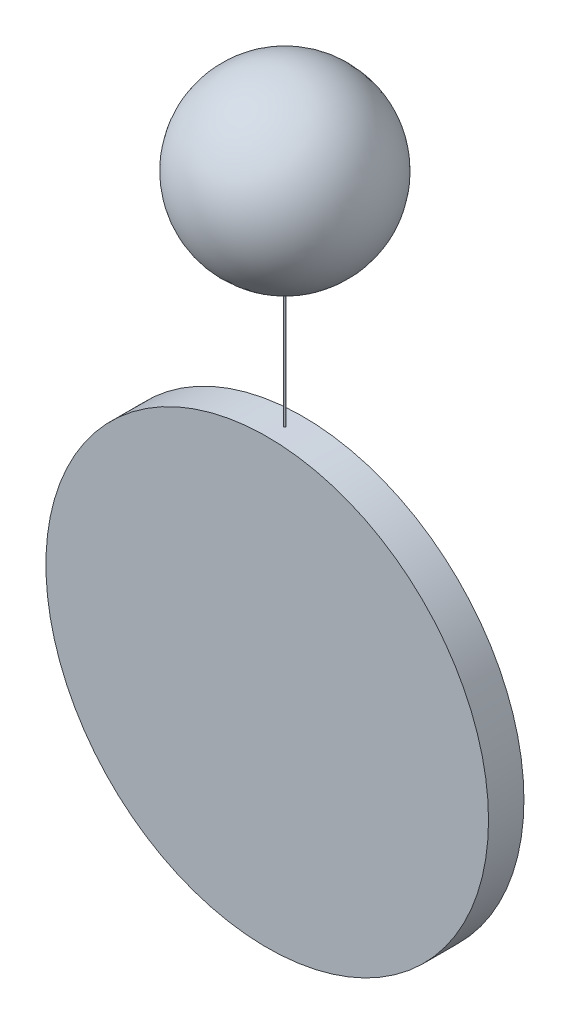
ISO-10303-21;
HEADER;
FILE_DESCRIPTION(('STEP AP214'),'2;1');
FILE_NAME('part.step','',(''),(''),'','','');
FILE_SCHEMA(('AUTOMOTIVE_DESIGN { 1 0 10303 214 1 1 1 1 }'));
ENDSEC;
DATA;
#1=APPLICATION_CONTEXT('core data for automotive mechanical design processes');
#2=APPLICATION_PROTOCOL_DEFINITION('international standard','automotive_design',2000,#1);
#3=PRODUCT_CONTEXT('',#1,'mechanical');
#4=PRODUCT('Part','Part','',(#3));
#5=PRODUCT_RELATED_PRODUCT_CATEGORY('part','',(#4));
#6=PRODUCT_DEFINITION_FORMATION('','',#4);
#7=PRODUCT_DEFINITION_CONTEXT('part definition',#1,'design');
#8=PRODUCT_DEFINITION('design','',#6,#7);
#9=PRODUCT_DEFINITION_SHAPE('','',#8);
#10=(LENGTH_UNIT() NAMED_UNIT(*) SI_UNIT(.MILLI.,.METRE.));
#11=(NAMED_UNIT(*) PLANE_ANGLE_UNIT() SI_UNIT($,.RADIAN.));
#12=(NAMED_UNIT(*) SI_UNIT($,.STERADIAN.) SOLID_ANGLE_UNIT());
#13=UNCERTAINTY_MEASURE_WITH_UNIT(LENGTH_MEASURE(1.E-05),#10,'distance_accuracy_value','');
#14=(GEOMETRIC_REPRESENTATION_CONTEXT(3) GLOBAL_UNCERTAINTY_ASSIGNED_CONTEXT((#13)) GLOBAL_UNIT_ASSIGNED_CONTEXT((#10,
#11,#12)) REPRESENTATION_CONTEXT('',''));
#15=CARTESIAN_POINT('',(0.,0.,0.));
#16=DIRECTION('',(0.,0.,1.));
#17=DIRECTION('',(1.,0.,0.));
#18=AXIS2_PLACEMENT_3D('',#15,#16,#17);
#19=CARTESIAN_POINT('',(0.,-25.,0.));
#20=DIRECTION('',(0.,1.,0.));
#21=DIRECTION('',(0.,0.,1.));
#22=AXIS2_PLACEMENT_3D('',#19,#20,#21);
#23=CYLINDRICAL_SURFACE('',#22,0.05);
#24=CARTESIAN_POINT('',(0.,0.,0.));
#25=DIRECTION('',(0.,1.,0.));
#26=DIRECTION('',(0.,0.,1.));
#27=AXIS2_PLACEMENT_3D('',#24,#25,#26);
#28=CIRCLE('',#27,0.05);
#29=CARTESIAN_POINT('',(0.0499999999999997,0.,0.));
#30=VERTEX_POINT('',#29);
#31=CARTESIAN_POINT('',(-0.0499999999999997,0.,0.));
#32=VERTEX_POINT('',#31);
#33=EDGE_CURVE('E52',#30,#32,#28,.T.);
#34=ORIENTED_EDGE('',*,*,#33,.F.);
#35=CARTESIAN_POINT('',(0.,0.,0.));
#36=DIRECTION('',(0.,1.,0.));
#37=DIRECTION('',(0.,0.,1.));
#38=AXIS2_PLACEMENT_3D('',#35,#36,#37);
#39=CIRCLE('',#38,0.05);
#40=EDGE_CURVE('E11',#32,#30,#39,.T.);
#41=ORIENTED_EDGE('',*,*,#40,.F.);
#42=EDGE_LOOP('',(#34,#41));
#43=FACE_BOUND('',#42,.T.);
#44=CARTESIAN_POINT('',(0.,-12.4999000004,0.0499999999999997));
#45=CARTESIAN_POINT('',(0.00280850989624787,-12.4999000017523,0.0499998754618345));
#46=CARTESIAN_POINT('',(0.0056190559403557,-12.4999009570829,0.0497625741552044));
#47=CARTESIAN_POINT('',(0.0111627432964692,-12.4999046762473,0.0488192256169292));
#48=CARTESIAN_POINT('',(0.0138957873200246,-12.4999074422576,0.048112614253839));
#49=CARTESIAN_POINT('',(0.0192033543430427,-12.4999144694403,0.0462507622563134));
#50=CARTESIAN_POINT('',(0.0217779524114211,-12.4999187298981,0.0450957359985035));
#51=CARTESIAN_POINT('',(0.026695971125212,-12.4999282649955,0.0423701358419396));
#52=CARTESIAN_POINT('',(0.0290394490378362,-12.4999335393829,0.040799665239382));
#53=CARTESIAN_POINT('',(0.033429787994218,-12.499944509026,0.0372874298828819));
#54=CARTESIAN_POINT('',(0.0354766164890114,-12.4999502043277,0.0353456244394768));
#55=CARTESIAN_POINT('',(0.0392152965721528,-12.499961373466,0.0311458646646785));
#56=CARTESIAN_POINT('',(0.0409071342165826,-12.4999668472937,0.0288878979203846));
#57=CARTESIAN_POINT('',(0.0438876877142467,-12.499976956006,0.0241200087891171));
#58=CARTESIAN_POINT('',(0.0451764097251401,-12.4999815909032,0.0216100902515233));
#59=CARTESIAN_POINT('',(0.047314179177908,-12.499989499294,0.01640952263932));
#60=CARTESIAN_POINT('',(0.048163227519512,-12.4999927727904,0.0137188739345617));
#61=CARTESIAN_POINT('',(0.0493975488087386,-12.499997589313,0.00823323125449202));
#62=CARTESIAN_POINT('',(0.0497828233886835,-12.4999991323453,0.00543823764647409));
#63=CARTESIAN_POINT('',(0.0500786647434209,-12.5000003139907,-0.000176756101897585));
#64=CARTESIAN_POINT('',(0.0499892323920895,-12.4999999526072,-0.00299675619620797));
#65=CARTESIAN_POINT('',(0.0493382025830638,-12.4999973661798,-0.00858170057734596));
#66=CARTESIAN_POINT('',(0.0487766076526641,-12.4999951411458,-0.0113466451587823));
#67=CARTESIAN_POINT('',(0.0471971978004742,-12.4999890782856,-0.0167430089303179));
#68=CARTESIAN_POINT('',(0.0461793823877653,-12.4999852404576,-0.0193744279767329));
#69=CARTESIAN_POINT('',(0.0437164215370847,-12.4999763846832,-0.0244290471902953));
#70=CARTESIAN_POINT('',(0.0422712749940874,-12.4999713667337,-0.0268522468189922));
#71=CARTESIAN_POINT('',(0.038994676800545,-12.4999607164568,-0.0314216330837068));
#72=CARTESIAN_POINT('',(0.0371632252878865,-12.4999550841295,-0.0335678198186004));
#73=CARTESIAN_POINT('',(0.0331659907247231,-12.4999438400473,-0.0375222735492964));
#74=CARTESIAN_POINT('',(0.0310002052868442,-12.4999382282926,-0.0393305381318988));
#75=CARTESIAN_POINT('',(0.0263957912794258,-12.4999276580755,-0.0425577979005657));
#76=CARTESIAN_POINT('',(0.0239571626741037,-12.4999226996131,-0.0439767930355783));
#77=CARTESIAN_POINT('',(0.018876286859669,-12.4999139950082,-0.0463852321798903));
#78=CARTESIAN_POINT('',(0.0162340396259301,-12.4999102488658,-0.0473746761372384));
#79=CARTESIAN_POINT('',(0.0108209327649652,-12.499904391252,-0.0488959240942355));
#80=CARTESIAN_POINT('',(0.00805007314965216,-12.4999022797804,-0.0494277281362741));
#81=CARTESIAN_POINT('',(0.00245841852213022,-12.4998999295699,-0.0500185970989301));
#82=CARTESIAN_POINT('',(-0.000362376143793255,-12.4998996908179,-0.0500776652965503));
#83=CARTESIAN_POINT('',(-0.00597384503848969,-12.4999011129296,-0.0497213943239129));
#84=CARTESIAN_POINT('',(-0.00876451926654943,-12.4999027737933,-0.049306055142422));
#85=CARTESIAN_POINT('',(-0.0142365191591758,-12.4999078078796,-0.0480127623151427));
#86=CARTESIAN_POINT('',(-0.0169178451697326,-12.4999111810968,-0.0471348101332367));
#87=CARTESIAN_POINT('',(-0.0220950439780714,-12.4999192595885,-0.0449412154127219));
#88=CARTESIAN_POINT('',(-0.0245909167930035,-12.4999239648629,-0.0436255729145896));
#89=CARTESIAN_POINT('',(-0.0293263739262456,-12.4999341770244,-0.0405939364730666));
#90=CARTESIAN_POINT('',(-0.0315659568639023,-12.4999396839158,-0.0388779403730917));
#91=CARTESIAN_POINT('',(-0.0357252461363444,-12.4999508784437,-0.0350943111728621));
#92=CARTESIAN_POINT('',(-0.0376449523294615,-12.4999565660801,-0.0330266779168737));
#93=CARTESIAN_POINT('',(-0.041110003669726,-12.4999674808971,-0.028598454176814));
#94=CARTESIAN_POINT('',(-0.0426553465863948,-12.4999727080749,-0.0262378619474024));
#95=CARTESIAN_POINT('',(-0.0453277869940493,-12.4999821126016,-0.0212907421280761));
#96=CARTESIAN_POINT('',(-0.0464548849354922,-12.4999862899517,-0.0187042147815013));
#97=CARTESIAN_POINT('',(-0.0482588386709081,-12.4999931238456,-0.013378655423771));
#98=CARTESIAN_POINT('',(-0.0489356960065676,-12.4999957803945,-0.0106396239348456));
#99=CARTESIAN_POINT('',(-0.0498199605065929,-12.4999992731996,-0.0050867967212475));
#100=CARTESIAN_POINT('',(-0.0500273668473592,-12.5000001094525,-0.00227300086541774));
#101=CARTESIAN_POINT('',(-0.0499668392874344,-12.4999998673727,0.00334944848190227));
#102=CARTESIAN_POINT('',(-0.0496989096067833,-12.4999987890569,0.00615810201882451));
#103=CARTESIAN_POINT('',(-0.0486953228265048,-12.4999948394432,0.0116905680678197));
#104=CARTESIAN_POINT('',(-0.0479596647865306,-12.4999919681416,0.0144143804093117));
#105=CARTESIAN_POINT('',(-0.0460414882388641,-12.4999847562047,0.0196998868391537));
#106=CARTESIAN_POINT('',(-0.0448589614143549,-12.499980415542,0.0222615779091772));
#107=CARTESIAN_POINT('',(-0.0420806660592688,-12.4999707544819,0.0271499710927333));
#108=CARTESIAN_POINT('',(-0.0404849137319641,-12.499965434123,0.0294766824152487));
#109=CARTESIAN_POINT('',(-0.0369256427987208,-12.4999544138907,0.0338289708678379));
#110=CARTESIAN_POINT('',(-0.0349621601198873,-12.4999487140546,0.0358545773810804));
#111=CARTESIAN_POINT('',(-0.0307224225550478,-12.4999375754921,0.0395479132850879));
#112=CARTESIAN_POINT('',(-0.0284460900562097,-12.499932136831,0.0412155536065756));
#113=CARTESIAN_POINT('',(-0.0236448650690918,-12.499922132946,0.0441456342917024));
#114=CARTESIAN_POINT('',(-0.021119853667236,-12.4999175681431,0.0454078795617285));
#115=CARTESIAN_POINT('',(-0.0158957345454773,-12.4999098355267,0.047489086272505));
#116=CARTESIAN_POINT('',(-0.01319683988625,-12.4999066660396,0.0483085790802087));
#117=CARTESIAN_POINT('',(-0.00873395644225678,-12.4999029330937,0.0492626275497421));
#118=CARTESIAN_POINT('',(-0.00699896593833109,-12.4999018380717,0.0495387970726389));
#119=CARTESIAN_POINT('',(-0.00350958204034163,-12.4999003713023,0.0499075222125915));
#120=CARTESIAN_POINT('',(-0.00175518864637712,-12.4998999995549,0.0500000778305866));
#121=CARTESIAN_POINT('',(0.,-12.4999000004,0.0499999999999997));
#122=B_SPLINE_CURVE_WITH_KNOTS('',3,(#44,#45,#46,#47,#48,#49,#50,#51,#52,#53,#54,#55,#56,#57,
#58,#59,#60,#61,#62,#63,#64,#65,#66,#67,#68,#69,#70,#71,#72,#73,#74,#75,#76,#77,#78,#79,#80,#81,
#82,#83,#84,#85,#86,#87,#88,#89,#90,#91,#92,#93,#94,#95,#96,#97,#98,#99,#100,#101,#102,#103,
#104,#105,#106,#107,#108,#109,#110,#111,#112,#113,#114,#115,#116,#117,#118,#119,#120,#121),
.UNSPECIFIED.,.T.,.F.,(4,2,2,2,2,2,2,2,2,2,2,2,2,2,2,2,2,2,2,2,2,2,2,2,2,2,2,2,2,2,2,2,2,2,2,2,
2,2,4),(0.,0.00841912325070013,0.0168483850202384,0.0252736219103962,0.0336967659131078,
0.0421208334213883,0.0505452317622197,0.0589695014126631,0.06739375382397,0.0758179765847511,
0.0842421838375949,0.0926663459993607,0.101090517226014,0.109514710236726,0.117938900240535,
0.126363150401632,0.134787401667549,0.143211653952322,0.151635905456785,0.160060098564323,
0.168484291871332,0.176908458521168,0.185332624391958,0.193756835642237,0.202181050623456,
0.210605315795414,0.219029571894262,0.227453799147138,0.235878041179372,0.244302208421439,
0.252726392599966,0.261150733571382,0.269574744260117,0.27799793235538,0.286423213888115,
0.294852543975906,0.303271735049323,0.308533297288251,0.313794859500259),.UNSPECIFIED.);
#123=CARTESIAN_POINT('',(0.,-12.4999000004,0.0499999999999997));
#124=VERTEX_POINT('',#123);
#125=EDGE_CURVE('E36',#124,#124,#122,.T.);
#126=ORIENTED_EDGE('',*,*,#125,.T.);
#127=EDGE_LOOP('',(#126));
#128=FACE_BOUND('',#127,.T.);
#129=ADVANCED_FACE('F32',(#43,#128),#23,.T.);
#130=CARTESIAN_POINT('',(0.,0.,0.));
#131=DIRECTION('',(1.,0.,0.));
#132=DIRECTION('',(0.,-1.,0.));
#133=AXIS2_PLACEMENT_3D('',#130,#131,#132);
#134=SPHERICAL_SURFACE('',#133,5.);
#135=CARTESIAN_POINT('',(0.,-4.,0.));
#136=DIRECTION('',(0.,1.,0.));
#137=DIRECTION('',(0.,0.,1.));
#138=AXIS2_PLACEMENT_3D('',#135,#136,#137);
#139=CIRCLE('',#138,3.);
#140=CARTESIAN_POINT('',(0.,-4.,3.));
#141=VERTEX_POINT('',#140);
#142=EDGE_CURVE('E86',#141,#141,#139,.T.);
#143=ORIENTED_EDGE('',*,*,#142,.T.);
#144=EDGE_LOOP('',(#143));
#145=FACE_BOUND('',#144,.T.);
#146=CARTESIAN_POINT('',(0.,0.,-4.));
#147=DIRECTION('',(0.,0.,1.));
#148=DIRECTION('',(1.,0.,0.));
#149=AXIS2_PLACEMENT_3D('',#146,#147,#148);
#150=CIRCLE('',#149,3.);
#151=CARTESIAN_POINT('',(3.,0.,-4.));
#152=VERTEX_POINT('',#151);
#153=EDGE_CURVE('E77',#152,#152,#150,.T.);
#154=ORIENTED_EDGE('',*,*,#153,.T.);
#155=EDGE_LOOP('',(#154));
#156=FACE_BOUND('',#155,.T.);
#157=ADVANCED_FACE('F34',(#145,#156),#134,.T.);
#158=CARTESIAN_POINT('',(0.,0.,-5.));
#159=DIRECTION('',(0.,0.,1.));
#160=DIRECTION('',(1.,0.,0.));
#161=AXIS2_PLACEMENT_3D('',#158,#159,#160);
#162=CYLINDRICAL_SURFACE('',#161,3.);
#163=CARTESIAN_POINT('',(0.,0.,0.));
#164=DIRECTION('',(0.,0.,1.));
#165=DIRECTION('',(1.,0.,0.));
#166=AXIS2_PLACEMENT_3D('',#163,#164,#165);
#167=CIRCLE('',#166,3.);
#168=CARTESIAN_POINT('',(3.,0.,0.));
#169=VERTEX_POINT('',#168);
#170=CARTESIAN_POINT('',(-3.,0.,0.));
#171=VERTEX_POINT('',#170);
#172=EDGE_CURVE('E83',#169,#171,#167,.T.);
#173=ORIENTED_EDGE('',*,*,#172,.T.);
#174=CARTESIAN_POINT('',(0.,0.,0.));
#175=DIRECTION('',(0.,-0.707106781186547,0.707106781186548));
#176=DIRECTION('',(0.,0.707106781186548,0.707106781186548));
#177=AXIS2_PLACEMENT_3D('',#174,#175,#176);
#178=ELLIPSE('',#177,4.24264068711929,3.);
#179=EDGE_CURVE('E89',#171,#169,#178,.T.);
#180=ORIENTED_EDGE('',*,*,#179,.T.);
#181=EDGE_LOOP('',(#173,#180));
#182=FACE_BOUND('',#181,.T.);
#183=ORIENTED_EDGE('',*,*,#153,.F.);
#184=EDGE_LOOP('',(#183));
#185=FACE_BOUND('',#184,.T.);
#186=ADVANCED_FACE('F115',(#182,#185),#162,.F.);
#187=CARTESIAN_POINT('',(0.,0.,0.));
#188=DIRECTION('',(0.,0.,1.));
#189=DIRECTION('',(1.,0.,0.));
#190=AXIS2_PLACEMENT_3D('',#187,#188,#189);
#191=PLANE('',#190);
#192=ORIENTED_EDGE('',*,*,#172,.F.);
#193=DIRECTION('',(-1.,0.,0.));
#194=VECTOR('',#193,1.);
#195=CARTESIAN_POINT('',(0.,0.,0.));
#196=LINE('',#195,#194);
#197=EDGE_CURVE('E46',#169,#30,#196,.T.);
#198=ORIENTED_EDGE('',*,*,#197,.T.);
#199=EDGE_CURVE('E71',#30,#32,#196,.T.);
#200=ORIENTED_EDGE('',*,*,#199,.T.);
#201=EDGE_CURVE('E60',#32,#171,#196,.T.);
#202=ORIENTED_EDGE('',*,*,#201,.T.);
#203=EDGE_LOOP('',(#192,#198,#200,#202));
#204=FACE_BOUND('',#203,.T.);
#205=ADVANCED_FACE('F79',(#204),#191,.F.);
#206=CARTESIAN_POINT('',(0.,-5.,0.));
#207=DIRECTION('',(0.,1.,0.));
#208=DIRECTION('',(0.,0.,1.));
#209=AXIS2_PLACEMENT_3D('',#206,#207,#208);
#210=CYLINDRICAL_SURFACE('',#209,3.);
#211=CARTESIAN_POINT('',(0.,0.,0.));
#212=DIRECTION('',(0.,1.,0.));
#213=DIRECTION('',(0.,0.,1.));
#214=AXIS2_PLACEMENT_3D('',#211,#212,#213);
#215=CIRCLE('',#214,3.);
#216=EDGE_CURVE('E72',#171,#169,#215,.T.);
#217=ORIENTED_EDGE('',*,*,#216,.T.);
#218=ORIENTED_EDGE('',*,*,#179,.F.);
#219=EDGE_LOOP('',(#217,#218));
#220=FACE_BOUND('',#219,.T.);
#221=ORIENTED_EDGE('',*,*,#142,.F.);
#222=EDGE_LOOP('',(#221));
#223=FACE_BOUND('',#222,.T.);
#224=ADVANCED_FACE('F122',(#220,#223),#210,.F.);
#225=CARTESIAN_POINT('',(0.,0.,0.));
#226=DIRECTION('',(0.,1.,0.));
#227=DIRECTION('',(0.,0.,1.));
#228=AXIS2_PLACEMENT_3D('',#225,#226,#227);
#229=PLANE('',#228);
#230=ORIENTED_EDGE('',*,*,#201,.F.);
#231=ORIENTED_EDGE('',*,*,#40,.T.);
#232=ORIENTED_EDGE('',*,*,#197,.F.);
#233=ORIENTED_EDGE('',*,*,#216,.F.);
#234=EDGE_LOOP('',(#230,#231,#232,#233));
#235=FACE_BOUND('',#234,.T.);
#236=ADVANCED_FACE('F74',(#235),#229,.F.);
#237=CARTESIAN_POINT('',(0.,0.,0.));
#238=DIRECTION('',(0.,1.,0.));
#239=DIRECTION('',(0.,0.,1.));
#240=AXIS2_PLACEMENT_3D('',#237,#238,#239);
#241=PLANE('',#240);
#242=ORIENTED_EDGE('',*,*,#199,.F.);
#243=ORIENTED_EDGE('',*,*,#33,.T.);
#244=EDGE_LOOP('',(#242,#243));
#245=FACE_BOUND('',#244,.T.);
#246=ADVANCED_FACE('F70',(#245),#241,.T.);
#247=CARTESIAN_POINT('',(0.,-25.,0.99999999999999));
#248=DIRECTION('',(0.,0.,-1.));
#249=DIRECTION('',(-1.,0.,0.));
#250=AXIS2_PLACEMENT_3D('',#247,#248,#249);
#251=CYLINDRICAL_SURFACE('',#250,12.5000999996);
#252=ORIENTED_EDGE('',*,*,#125,.F.);
#253=EDGE_LOOP('',(#252));
#254=FACE_BOUND('',#253,.T.);
#255=CARTESIAN_POINT('',(0.,-25.,0.99999999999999));
#256=DIRECTION('',(0.,0.,1.));
#257=DIRECTION('',(1.,0.,0.));
#258=AXIS2_PLACEMENT_3D('',#255,#256,#257);
#259=CIRCLE('',#258,12.5000999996);
#260=CARTESIAN_POINT('',(12.5000999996,-25.,0.999999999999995));
#261=VERTEX_POINT('',#260);
#262=EDGE_CURVE('E93',#261,#261,#259,.T.);
#263=ORIENTED_EDGE('',*,*,#262,.F.);
#264=EDGE_LOOP('',(#263));
#265=FACE_BOUND('',#264,.T.);
#266=CARTESIAN_POINT('',(0.,-25.,-1.00000000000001));
#267=DIRECTION('',(0.,0.,1.));
#268=DIRECTION('',(1.,0.,0.));
#269=AXIS2_PLACEMENT_3D('',#266,#267,#268);
#270=CIRCLE('',#269,12.5000999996);
#271=CARTESIAN_POINT('',(12.5000999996,-25.,-1.00000000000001));
#272=VERTEX_POINT('',#271);
#273=EDGE_CURVE('E96',#272,#272,#270,.T.);
#274=ORIENTED_EDGE('',*,*,#273,.T.);
#275=EDGE_LOOP('',(#274));
#276=FACE_BOUND('',#275,.T.);
#277=ADVANCED_FACE('F100',(#254,#265,#276),#251,.T.);
#278=CARTESIAN_POINT('',(0.,-25.,0.99999999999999));
#279=DIRECTION('',(0.,0.,1.));
#280=DIRECTION('',(1.,0.,0.));
#281=AXIS2_PLACEMENT_3D('',#278,#279,#280);
#282=PLANE('',#281);
#283=ORIENTED_EDGE('',*,*,#262,.T.);
#284=EDGE_LOOP('',(#283));
#285=FACE_BOUND('',#284,.T.);
#286=ADVANCED_FACE('F104',(#285),#282,.T.);
#287=CARTESIAN_POINT('',(0.,-25.,-1.00000000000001));
#288=DIRECTION('',(0.,0.,1.));
#289=DIRECTION('',(1.,0.,0.));
#290=AXIS2_PLACEMENT_3D('',#287,#288,#289);
#291=PLANE('',#290);
#292=ORIENTED_EDGE('',*,*,#273,.F.);
#293=EDGE_LOOP('',(#292));
#294=FACE_BOUND('',#293,.T.);
#295=ADVANCED_FACE('F102',(#294),#291,.F.);
#296=CLOSED_SHELL('',(#129,#157,#186,#205,#224,#236,#246,#277,#286,#295));
#297=MANIFOLD_SOLID_BREP('B2',#296);
#298=ADVANCED_BREP_SHAPE_REPRESENTATION('',(#18,#297),#14);
#299=SHAPE_DEFINITION_REPRESENTATION(#9,#298);
ENDSEC;
END-ISO-10303-21;
